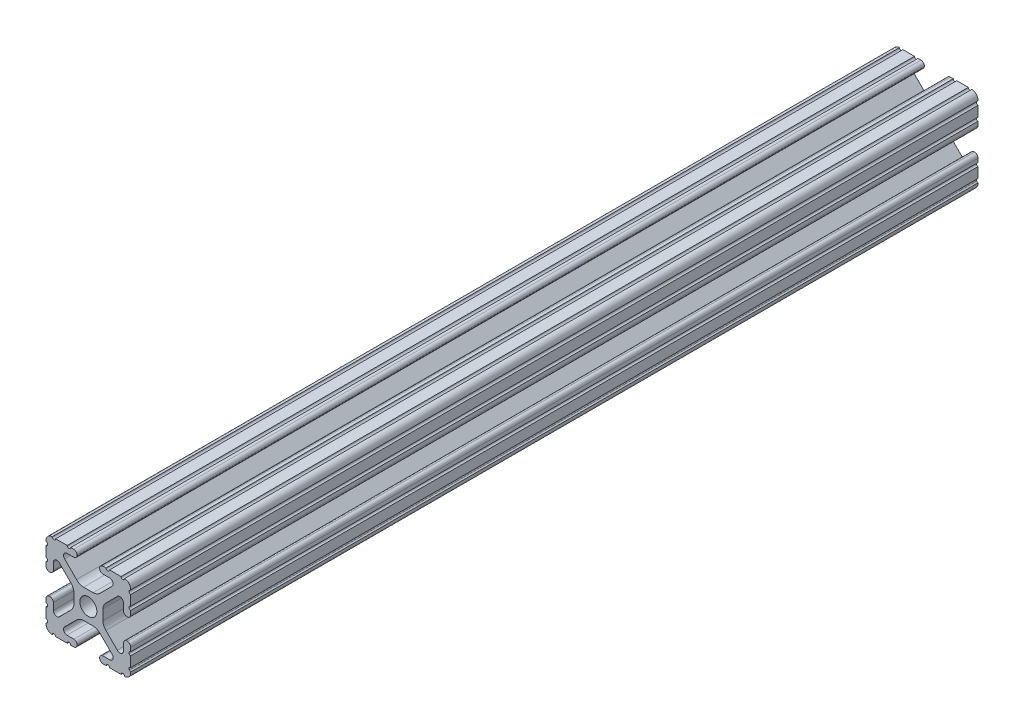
from build123d import *

# Parameters (mm, degrees)
SKETCH1_R      = 2.5527
EXTRUDE1_DEPTH = 254


with BuildPart() as part:
    # Sketch1 → Extrude1 (new body)
    with BuildSketch(Plane.XY):
        with BuildLine():
            Line((17.038313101, 2.077935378), (19.096863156, 2.077935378))
            ThreePointArc((19.096863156, 2.077935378), (20.070175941, 2.756378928), (19.787510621, 3.908647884))
            Line((19.787510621, 3.908647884), (16.248653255, 7.44750525))
            ThreePointArc((16.248653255, 7.44750525), (15.278998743, 8.110009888), (14.134853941, 8.374726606))
            Line((14.134853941, 8.374726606), (11.265146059, 8.374726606))
            ThreePointArc((11.265146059, 8.374726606), (10.121001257, 8.110009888), (9.151346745, 7.44750525))
            Line((9.151346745, 7.44750525), (5.612489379, 3.908647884))
            ThreePointArc((5.612489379, 3.908647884), (5.329824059, 2.756378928), (6.303136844, 2.077935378))
            Line((6.303136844, 2.077935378), (8.361686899, 2.077935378))
            ThreePointArc((8.361686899, 2.077935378), (9.018091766, 1.793314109), (9.339719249, 1.154226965))
            Line((9.339719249, 1.154226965), (9.337419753, 1.053846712))
            ThreePointArc((9.337419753, 1.053846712), (9.02595881, 0.331571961), (8.30017833, 0.028369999))
            Line((8.30017833, 0.028369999), (7.40227842, 0.011209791))
            ThreePointArc((7.40227842, 0.011209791), (6.877921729, 0.518842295), (6.36465438, 0))
            Line((6.36465438, 0), (2.895272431, 0))
            ThreePointArc((2.895272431, 0), (2.376399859, 0.518872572), (1.857527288, 0))
            ThreePointArc((1.857527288, 0), (0.477891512, 0.613737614), (0.009934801, 2.049385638))
            Line((0.009934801, 2.049385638), (0.378548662, 2.327873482))
            ThreePointArc((0.378548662, 2.327873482), (0.47610861, 2.889014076), (0, 3.201611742))
            Line((0, 3.201611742), (0, 6.29055529))
            ThreePointArc((0, 6.29055529), (0.518872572, 6.809427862), (0, 7.328300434))
            Line((0, 7.328300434), (0, 8.467340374))
            ThreePointArc((0, 8.467340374), (0.28197862, 9.201633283), (0.994901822, 9.533956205))
            Line((0.994901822, 9.533956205), (1.09517109, 9.539273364))
            ThreePointArc((1.09517109, 9.539273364), (1.866108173, 9.258539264), (2.199674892, 8.508946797))
            Line((2.199674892, 8.508946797), (2.199674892, 6.450394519))
            ThreePointArc((2.199674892, 6.450394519), (2.856900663, 5.461224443), (4.01600321, 5.719844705))
            Line((4.01600321, 5.719844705), (7.448242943, 9.152084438))
            ThreePointArc((7.448242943, 9.152084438), (8.091865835, 10.076485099), (8.374726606, 11.166786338))
            Line((8.374726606, 11.166786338), (8.374726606, 14.233213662))
            ThreePointArc((8.374726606, 14.233213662), (8.091865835, 15.323514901), (7.448242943, 16.247915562))
            Line((7.448242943, 16.247915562), (4.01600321, 19.680155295))
            ThreePointArc((4.01600321, 19.680155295), (2.856900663, 19.938775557), (2.199674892, 18.949605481))
            Line((2.199674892, 18.949605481), (2.199674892, 16.891053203))
            ThreePointArc((2.199674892, 16.891053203), (1.866108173, 16.141460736), (1.09517109, 15.860726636))
            Line((1.09517109, 15.860726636), (0.994901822, 15.866043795))
            ThreePointArc((0.994901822, 15.866043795), (0.28197862, 16.198366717), (0, 16.932659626))
            Line((0, 16.932659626), (0, 18.071699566))
            ThreePointArc((0, 18.071699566), (0.518872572, 18.590572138), (0, 19.10944471))
            Line((0, 19.10944471), (0, 22.198388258))
            ThreePointArc((0, 22.198388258), (0.47610861, 22.510985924), (0.378548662, 23.072126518))
            Line((0.378548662, 23.072126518), (0.009934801, 23.350614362))
            ThreePointArc((0.009934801, 23.350614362), (0.477891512, 24.786262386), (1.857527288, 25.4))
            ThreePointArc((1.857527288, 25.4), (2.376399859, 24.881127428), (2.895272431, 25.4))
            Line((2.895272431, 25.4), (6.36465438, 25.4))
            ThreePointArc((6.36465438, 25.4), (6.877921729, 24.881157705), (7.40227842, 25.388790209))
            Line((7.40227842, 25.388790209), (8.30017833, 25.371630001))
            ThreePointArc((8.30017833, 25.371630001), (9.02595881, 25.068428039), (9.337419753, 24.346153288))
            Line((9.337419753, 24.346153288), (9.339719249, 24.245773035))
            ThreePointArc((9.339719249, 24.245773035), (9.018091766, 23.606685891), (8.361686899, 23.322064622))
            Line((8.361686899, 23.322064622), (6.303136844, 23.322064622))
            ThreePointArc((6.303136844, 23.322064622), (5.329824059, 22.643621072), (5.612489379, 21.491352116))
            Line((5.612489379, 21.491352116), (9.151346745, 17.95249475))
            ThreePointArc((9.151346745, 17.95249475), (10.121001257, 17.289990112), (11.265146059, 17.025273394))
            Line((11.265146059, 17.025273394), (14.134853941, 17.025273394))
            ThreePointArc((14.134853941, 17.025273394), (15.278998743, 17.289990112), (16.248653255, 17.95249475))
            Line((16.248653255, 17.95249475), (19.787510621, 21.491352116))
            ThreePointArc((19.787510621, 21.491352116), (20.070175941, 22.643621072), (19.096863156, 23.322064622))
            Line((19.096863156, 23.322064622), (17.038313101, 23.322064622))
            ThreePointArc((17.038313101, 23.322064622), (16.381908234, 23.606685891), (16.060280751, 24.245773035))
            Line((16.060280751, 24.245773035), (16.062580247, 24.346153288))
            ThreePointArc((16.062580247, 24.346153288), (16.37404119, 25.068428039), (17.09982167, 25.371630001))
            Line((17.09982167, 25.371630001), (17.99772158, 25.388790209))
            ThreePointArc((17.99772158, 25.388790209), (18.522078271, 24.881157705), (19.03534562, 25.4))
            Line((19.03534562, 25.4), (22.504727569, 25.4))
            ThreePointArc((22.504727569, 25.4), (23.023600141, 24.881127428), (23.542472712, 25.4))
            ThreePointArc((23.542472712, 25.4), (24.922108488, 24.786262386), (25.390065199, 23.350614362))
            Line((25.390065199, 23.350614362), (25.021451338, 23.072126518))
            ThreePointArc((25.021451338, 23.072126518), (24.92389139, 22.510985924), (25.4, 22.198388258))
            Line((25.4, 22.198388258), (25.4, 19.10944471))
            ThreePointArc((25.4, 19.10944471), (24.881127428, 18.590572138), (25.4, 18.071699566))
            Line((25.4, 18.071699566), (25.4, 16.932659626))
            ThreePointArc((25.4, 16.932659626), (25.11802138, 16.198366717), (24.405098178, 15.866043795))
            Line((24.405098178, 15.866043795), (24.30482891, 15.860726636))
            ThreePointArc((24.30482891, 15.860726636), (23.533891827, 16.141460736), (23.200325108, 16.891053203))
            Line((23.200325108, 16.891053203), (23.200325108, 18.949605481))
            ThreePointArc((23.200325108, 18.949605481), (22.543099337, 19.938775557), (21.38399679, 19.680155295))
            Line((21.38399679, 19.680155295), (17.951757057, 16.247915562))
            ThreePointArc((17.951757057, 16.247915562), (17.308134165, 15.323514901), (17.025273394, 14.233213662))
            Line((17.025273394, 14.233213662), (17.025273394, 11.166786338))
            ThreePointArc((17.025273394, 11.166786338), (17.308134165, 10.076485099), (17.951757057, 9.152084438))
            Line((17.951757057, 9.152084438), (21.38399679, 5.719844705))
            ThreePointArc((21.38399679, 5.719844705), (22.543099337, 5.461224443), (23.200325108, 6.450394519))
            Line((23.200325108, 6.450394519), (23.200325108, 8.508946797))
            ThreePointArc((23.200325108, 8.508946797), (23.533891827, 9.258539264), (24.30482891, 9.539273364))
            Line((24.30482891, 9.539273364), (24.405098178, 9.533956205))
            ThreePointArc((24.405098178, 9.533956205), (25.11802138, 9.201633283), (25.4, 8.467340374))
            Line((25.4, 8.467340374), (25.4, 7.328300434))
            ThreePointArc((25.4, 7.328300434), (24.881127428, 6.809427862), (25.4, 6.29055529))
            Line((25.4, 6.29055529), (25.4, 3.201611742))
            ThreePointArc((25.4, 3.201611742), (24.92389139, 2.889014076), (25.021451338, 2.327873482))
            Line((25.021451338, 2.327873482), (25.390065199, 2.049385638))
            ThreePointArc((25.390065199, 2.049385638), (24.922108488, 0.613737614), (23.542472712, 0))
            ThreePointArc((23.542472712, 0), (23.023600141, 0.518872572), (22.504727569, 0))
            Line((22.504727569, 0), (19.03534562, 0))
            ThreePointArc((19.03534562, 0), (18.522078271, 0.518842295), (17.99772158, 0.011209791))
            Line((17.99772158, 0.011209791), (17.09982167, 0.028369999))
            ThreePointArc((17.09982167, 0.028369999), (16.37404119, 0.331571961), (16.062580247, 1.053846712))
            Line((16.062580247, 1.053846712), (16.060280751, 1.154226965))
            ThreePointArc((16.060280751, 1.154226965), (16.381908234, 1.793314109), (17.038313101, 2.077935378))
        make_face()
        with Locations((12.7, 12.7)):
            Circle(SKETCH1_R, mode=Mode.SUBTRACT)
    extrude(amount=EXTRUDE1_DEPTH)


solid = part.part
